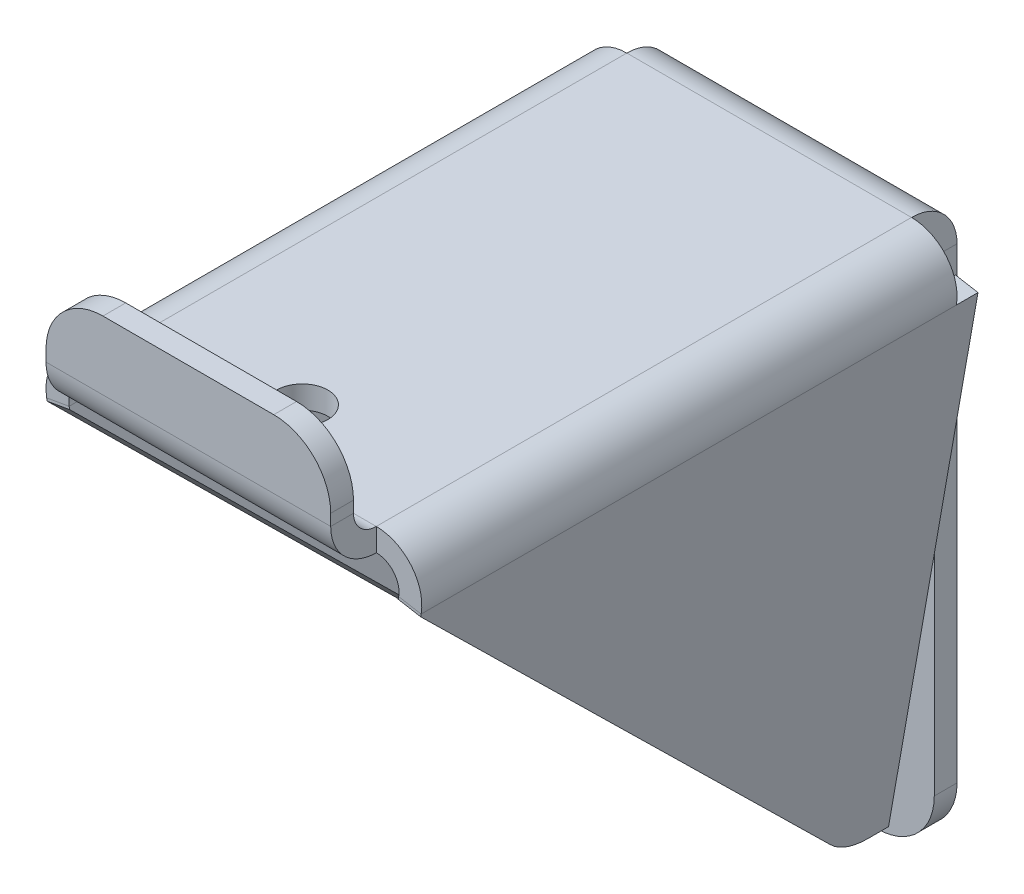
ISO-10303-21;
HEADER;
FILE_DESCRIPTION(('STEP AP214'),'2;1');
FILE_NAME('part.step','',(''),(''),'','','');
FILE_SCHEMA(('AUTOMOTIVE_DESIGN { 1 0 10303 214 1 1 1 1 }'));
ENDSEC;
DATA;
#1=APPLICATION_CONTEXT('core data for automotive mechanical design processes');
#2=APPLICATION_PROTOCOL_DEFINITION('international standard','automotive_design',2000,#1);
#3=PRODUCT_CONTEXT('',#1,'mechanical');
#4=PRODUCT('Part','Part','',(#3));
#5=PRODUCT_RELATED_PRODUCT_CATEGORY('part','',(#4));
#6=PRODUCT_DEFINITION_FORMATION('','',#4);
#7=PRODUCT_DEFINITION_CONTEXT('part definition',#1,'design');
#8=PRODUCT_DEFINITION('design','',#6,#7);
#9=PRODUCT_DEFINITION_SHAPE('','',#8);
#10=(LENGTH_UNIT() NAMED_UNIT(*) SI_UNIT(.MILLI.,.METRE.));
#11=(NAMED_UNIT(*) PLANE_ANGLE_UNIT() SI_UNIT($,.RADIAN.));
#12=(NAMED_UNIT(*) SI_UNIT($,.STERADIAN.) SOLID_ANGLE_UNIT());
#13=UNCERTAINTY_MEASURE_WITH_UNIT(LENGTH_MEASURE(1.E-05),#10,'distance_accuracy_value','');
#14=(GEOMETRIC_REPRESENTATION_CONTEXT(3) GLOBAL_UNCERTAINTY_ASSIGNED_CONTEXT((#13)) GLOBAL_UNIT_ASSIGNED_CONTEXT((#10,
#11,#12)) REPRESENTATION_CONTEXT('',''));
#15=CARTESIAN_POINT('',(0.,0.,0.));
#16=DIRECTION('',(0.,0.,1.));
#17=DIRECTION('',(1.,0.,0.));
#18=AXIS2_PLACEMENT_3D('',#15,#16,#17);
#19=CARTESIAN_POINT('',(12.5,25.0000000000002,53.));
#20=DIRECTION('',(0.,-1.,0.));
#21=DIRECTION('',(0.,0.,-1.));
#22=AXIS2_PLACEMENT_3D('',#19,#20,#21);
#23=PLANE('',#22);
#24=CARTESIAN_POINT('',(0.,25.0000000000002,43.));
#25=DIRECTION('',(0.,1.,0.));
#26=DIRECTION('',(0.,0.,1.));
#27=AXIS2_PLACEMENT_3D('',#24,#25,#26);
#28=CIRCLE('',#27,2.25);
#29=CARTESIAN_POINT('',(0.,25.0000000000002,45.25));
#30=VERTEX_POINT('',#29);
#31=EDGE_CURVE('E672',#30,#30,#28,.T.);
#32=ORIENTED_EDGE('',*,*,#31,.F.);
#33=EDGE_LOOP('',(#32));
#34=FACE_BOUND('',#33,.T.);
#35=DIRECTION('',(1.,0.,0.));
#36=VECTOR('',#35,1.);
#37=CARTESIAN_POINT('',(12.5,25.0000000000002,49.));
#38=LINE('',#37,#36);
#39=CARTESIAN_POINT('',(12.5,25.0000000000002,49.));
#40=VERTEX_POINT('',#39);
#41=CARTESIAN_POINT('',(-12.5,25.0000000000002,49.));
#42=VERTEX_POINT('',#41);
#43=EDGE_CURVE('E462',#40,#42,#38,.F.);
#44=ORIENTED_EDGE('',*,*,#43,.F.);
#45=DIRECTION('',(0.,0.,-1.));
#46=VECTOR('',#45,1.);
#47=CARTESIAN_POINT('',(12.5,25.0000000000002,53.));
#48=LINE('',#47,#46);
#49=CARTESIAN_POINT('',(12.5,25.,1.99999999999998));
#50=VERTEX_POINT('',#49);
#51=EDGE_CURVE('E476',#40,#50,#48,.T.);
#52=ORIENTED_EDGE('',*,*,#51,.T.);
#53=DIRECTION('',(-1.,0.,0.));
#54=VECTOR('',#53,1.);
#55=CARTESIAN_POINT('',(12.5,25.,1.99999999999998));
#56=LINE('',#55,#54);
#57=CARTESIAN_POINT('',(-12.5,25.,1.99999999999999));
#58=VERTEX_POINT('',#57);
#59=EDGE_CURVE('E483',#58,#50,#56,.F.);
#60=ORIENTED_EDGE('',*,*,#59,.F.);
#61=DIRECTION('',(0.,0.,1.));
#62=VECTOR('',#61,1.);
#63=CARTESIAN_POINT('',(-12.5,25.0000000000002,53.));
#64=LINE('',#63,#62);
#65=EDGE_CURVE('E472',#58,#42,#64,.T.);
#66=ORIENTED_EDGE('',*,*,#65,.T.);
#67=EDGE_LOOP('',(#44,#52,#60,#66));
#68=FACE_BOUND('',#67,.T.);
#69=ADVANCED_FACE('F114',(#34,#68),#23,.F.);
#70=CARTESIAN_POINT('',(12.5,23.0000000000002,53.));
#71=DIRECTION('',(0.,-1.,0.));
#72=DIRECTION('',(0.,0.,-1.));
#73=AXIS2_PLACEMENT_3D('',#70,#71,#72);
#74=PLANE('',#73);
#75=CARTESIAN_POINT('',(0.,23.0000000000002,43.));
#76=DIRECTION('',(0.,-1.,0.));
#77=DIRECTION('',(0.,0.,-1.));
#78=AXIS2_PLACEMENT_3D('',#75,#76,#77);
#79=CIRCLE('',#78,2.25);
#80=CARTESIAN_POINT('',(0.,23.0000000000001,40.75));
#81=VERTEX_POINT('',#80);
#82=EDGE_CURVE('E334',#81,#81,#79,.T.);
#83=ORIENTED_EDGE('',*,*,#82,.F.);
#84=EDGE_LOOP('',(#83));
#85=FACE_BOUND('',#84,.T.);
#86=DIRECTION('',(0.,0.,1.));
#87=VECTOR('',#86,1.);
#88=CARTESIAN_POINT('',(12.5,23.,0.));
#89=LINE('',#88,#87);
#90=CARTESIAN_POINT('',(12.5,23.0000000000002,49.));
#91=VERTEX_POINT('',#90);
#92=CARTESIAN_POINT('',(12.5,23.,1.99999999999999));
#93=VERTEX_POINT('',#92);
#94=EDGE_CURVE('E481',#91,#93,#89,.F.);
#95=ORIENTED_EDGE('',*,*,#94,.F.);
#96=DIRECTION('',(1.,0.,0.));
#97=VECTOR('',#96,1.);
#98=CARTESIAN_POINT('',(12.5,23.0000000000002,49.));
#99=LINE('',#98,#97);
#100=CARTESIAN_POINT('',(-12.5,23.0000000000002,49.));
#101=VERTEX_POINT('',#100);
#102=EDGE_CURVE('E449',#91,#101,#99,.F.);
#103=ORIENTED_EDGE('',*,*,#102,.T.);
#104=DIRECTION('',(0.,0.,-1.));
#105=VECTOR('',#104,1.);
#106=CARTESIAN_POINT('',(-12.5,23.0000000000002,53.));
#107=LINE('',#106,#105);
#108=CARTESIAN_POINT('',(-12.5,23.,2.));
#109=VERTEX_POINT('',#108);
#110=EDGE_CURVE('E479',#109,#101,#107,.F.);
#111=ORIENTED_EDGE('',*,*,#110,.F.);
#112=DIRECTION('',(-1.,0.,0.));
#113=VECTOR('',#112,1.);
#114=CARTESIAN_POINT('',(12.5,23.,1.99999999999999));
#115=LINE('',#114,#113);
#116=EDGE_CURVE('E489',#93,#109,#115,.T.);
#117=ORIENTED_EDGE('',*,*,#116,.F.);
#118=EDGE_LOOP('',(#95,#103,#111,#117));
#119=FACE_BOUND('',#118,.T.);
#120=ADVANCED_FACE('F652',(#85,#119),#74,.T.);
#121=CARTESIAN_POINT('',(-12.5,25.,-2.));
#122=DIRECTION('',(-1.,0.,0.));
#123=DIRECTION('',(0.,-1.,0.));
#124=AXIS2_PLACEMENT_3D('',#121,#122,#123);
#125=PLANE('',#124);
#126=DIRECTION('',(0.,-1.,0.));
#127=VECTOR('',#126,1.);
#128=CARTESIAN_POINT('',(-12.5,25.,-2.));
#129=LINE('',#128,#127);
#130=CARTESIAN_POINT('',(-12.5,21.,-2.));
#131=VERTEX_POINT('',#130);
#132=CARTESIAN_POINT('',(-12.5,-20.,-2.));
#133=VERTEX_POINT('',#132);
#134=EDGE_CURVE('E520',#131,#133,#129,.T.);
#135=ORIENTED_EDGE('',*,*,#134,.T.);
#136=DIRECTION('',(0.,0.,1.));
#137=VECTOR('',#136,1.);
#138=CARTESIAN_POINT('',(-12.5,-20.,-2.));
#139=LINE('',#138,#137);
#140=CARTESIAN_POINT('',(-12.5,-20.,0.));
#141=VERTEX_POINT('',#140);
#142=EDGE_CURVE('E566',#133,#141,#139,.T.);
#143=ORIENTED_EDGE('',*,*,#142,.T.);
#144=DIRECTION('',(0.,-1.,0.));
#145=VECTOR('',#144,1.);
#146=CARTESIAN_POINT('',(-12.5,25.,0.));
#147=LINE('',#146,#145);
#148=CARTESIAN_POINT('',(-12.5,21.,0.));
#149=VERTEX_POINT('',#148);
#150=EDGE_CURVE('E529',#149,#141,#147,.T.);
#151=ORIENTED_EDGE('',*,*,#150,.F.);
#152=DIRECTION('',(0.,0.,-1.));
#153=VECTOR('',#152,1.);
#154=CARTESIAN_POINT('',(-12.5,21.,0.));
#155=LINE('',#154,#153);
#156=EDGE_CURVE('E501',#149,#131,#155,.T.);
#157=ORIENTED_EDGE('',*,*,#156,.T.);
#158=EDGE_LOOP('',(#135,#143,#151,#157));
#159=FACE_BOUND('',#158,.T.);
#160=ADVANCED_FACE('F693',(#159),#125,.T.);
#161=CARTESIAN_POINT('',(12.5,-25.,-2.));
#162=DIRECTION('',(0.,0.,1.));
#163=DIRECTION('',(1.,0.,0.));
#164=AXIS2_PLACEMENT_3D('',#161,#162,#163);
#165=PLANE('',#164);
#166=CARTESIAN_POINT('',(0.,10.,-2.));
#167=DIRECTION('',(0.,0.,1.));
#168=DIRECTION('',(1.,0.,0.));
#169=AXIS2_PLACEMENT_3D('',#166,#167,#168);
#170=CIRCLE('',#169,2.75);
#171=CARTESIAN_POINT('',(2.75,10.,-2.));
#172=VERTEX_POINT('',#171);
#173=EDGE_CURVE('E675',#172,#172,#170,.T.);
#174=ORIENTED_EDGE('',*,*,#173,.T.);
#175=EDGE_LOOP('',(#174));
#176=FACE_BOUND('',#175,.T.);
#177=DIRECTION('',(1.,0.,0.));
#178=VECTOR('',#177,1.);
#179=CARTESIAN_POINT('',(-12.5,-25.,-2.));
#180=LINE('',#179,#178);
#181=CARTESIAN_POINT('',(-7.5,-25.,-2.));
#182=VERTEX_POINT('',#181);
#183=CARTESIAN_POINT('',(7.5,-25.,-2.));
#184=VERTEX_POINT('',#183);
#185=EDGE_CURVE('E524',#182,#184,#180,.T.);
#186=ORIENTED_EDGE('',*,*,#185,.F.);
#187=CARTESIAN_POINT('',(-7.5,-20.,-2.));
#188=DIRECTION('',(0.,0.,1.));
#189=DIRECTION('',(1.,0.,0.));
#190=AXIS2_PLACEMENT_3D('',#187,#188,#189);
#191=CIRCLE('',#190,5.);
#192=EDGE_CURVE('E580',#182,#133,#191,.F.);
#193=ORIENTED_EDGE('',*,*,#192,.T.);
#194=ORIENTED_EDGE('',*,*,#134,.F.);
#195=DIRECTION('',(-1.,0.,0.));
#196=VECTOR('',#195,1.);
#197=CARTESIAN_POINT('',(-12.5,21.,-2.));
#198=LINE('',#197,#196);
#199=CARTESIAN_POINT('',(12.5,21.,-2.));
#200=VERTEX_POINT('',#199);
#201=EDGE_CURVE('E494',#131,#200,#198,.F.);
#202=ORIENTED_EDGE('',*,*,#201,.T.);
#203=DIRECTION('',(0.,1.,0.));
#204=VECTOR('',#203,1.);
#205=CARTESIAN_POINT('',(12.5,25.,-2.));
#206=LINE('',#205,#204);
#207=CARTESIAN_POINT('',(12.5,-20.,-2.));
#208=VERTEX_POINT('',#207);
#209=EDGE_CURVE('E518',#208,#200,#206,.T.);
#210=ORIENTED_EDGE('',*,*,#209,.F.);
#211=CARTESIAN_POINT('',(7.5,-20.,-2.));
#212=DIRECTION('',(0.,0.,1.));
#213=DIRECTION('',(1.,0.,0.));
#214=AXIS2_PLACEMENT_3D('',#211,#212,#213);
#215=CIRCLE('',#214,5.);
#216=EDGE_CURVE('E578',#208,#184,#215,.F.);
#217=ORIENTED_EDGE('',*,*,#216,.T.);
#218=EDGE_LOOP('',(#186,#193,#194,#202,#210,#217));
#219=FACE_BOUND('',#218,.T.);
#220=ADVANCED_FACE('F688',(#176,#219),#165,.F.);
#221=CARTESIAN_POINT('',(12.5,-25.,0.));
#222=DIRECTION('',(0.,0.,1.));
#223=DIRECTION('',(1.,0.,0.));
#224=AXIS2_PLACEMENT_3D('',#221,#222,#223);
#225=PLANE('',#224);
#226=CARTESIAN_POINT('',(0.,10.,0.));
#227=DIRECTION('',(0.,0.,1.));
#228=DIRECTION('',(1.,0.,0.));
#229=AXIS2_PLACEMENT_3D('',#226,#227,#228);
#230=CIRCLE('',#229,2.75);
#231=CARTESIAN_POINT('',(2.75,10.,0.));
#232=VERTEX_POINT('',#231);
#233=EDGE_CURVE('E678',#232,#232,#230,.T.);
#234=ORIENTED_EDGE('',*,*,#233,.F.);
#235=EDGE_LOOP('',(#234));
#236=FACE_BOUND('',#235,.T.);
#237=ORIENTED_EDGE('',*,*,#150,.T.);
#238=CARTESIAN_POINT('',(-7.5,-20.,0.));
#239=DIRECTION('',(0.,0.,1.));
#240=DIRECTION('',(1.,0.,0.));
#241=AXIS2_PLACEMENT_3D('',#238,#239,#240);
#242=CIRCLE('',#241,5.);
#243=CARTESIAN_POINT('',(-7.5,-25.,0.));
#244=VERTEX_POINT('',#243);
#245=EDGE_CURVE('E571',#141,#244,#242,.T.);
#246=ORIENTED_EDGE('',*,*,#245,.T.);
#247=DIRECTION('',(1.,0.,0.));
#248=VECTOR('',#247,1.);
#249=CARTESIAN_POINT('',(-12.5,-25.,0.));
#250=LINE('',#249,#248);
#251=CARTESIAN_POINT('',(7.5,-25.,0.));
#252=VERTEX_POINT('',#251);
#253=EDGE_CURVE('E521',#244,#252,#250,.T.);
#254=ORIENTED_EDGE('',*,*,#253,.T.);
#255=CARTESIAN_POINT('',(7.5,-20.,0.));
#256=DIRECTION('',(0.,0.,1.));
#257=DIRECTION('',(1.,0.,0.));
#258=AXIS2_PLACEMENT_3D('',#255,#256,#257);
#259=CIRCLE('',#258,5.);
#260=CARTESIAN_POINT('',(12.5,-20.,0.));
#261=VERTEX_POINT('',#260);
#262=EDGE_CURVE('E569',#252,#261,#259,.T.);
#263=ORIENTED_EDGE('',*,*,#262,.T.);
#264=DIRECTION('',(0.,1.,0.));
#265=VECTOR('',#264,1.);
#266=CARTESIAN_POINT('',(12.5,25.,0.));
#267=LINE('',#266,#265);
#268=CARTESIAN_POINT('',(12.5,21.,0.));
#269=VERTEX_POINT('',#268);
#270=EDGE_CURVE('E515',#261,#269,#267,.T.);
#271=ORIENTED_EDGE('',*,*,#270,.T.);
#272=DIRECTION('',(-1.,0.,0.));
#273=VECTOR('',#272,1.);
#274=CARTESIAN_POINT('',(-12.5,21.,0.));
#275=LINE('',#274,#273);
#276=EDGE_CURVE('E507',#149,#269,#275,.F.);
#277=ORIENTED_EDGE('',*,*,#276,.F.);
#278=EDGE_LOOP('',(#237,#246,#254,#263,#271,#277));
#279=FACE_BOUND('',#278,.T.);
#280=ADVANCED_FACE('F684',(#236,#279),#225,.T.);
#281=CARTESIAN_POINT('',(12.5,25.,-2.));
#282=DIRECTION('',(1.,0.,0.));
#283=DIRECTION('',(0.,1.,0.));
#284=AXIS2_PLACEMENT_3D('',#281,#282,#283);
#285=PLANE('',#284);
#286=ORIENTED_EDGE('',*,*,#270,.F.);
#287=DIRECTION('',(0.,0.,1.));
#288=VECTOR('',#287,1.);
#289=CARTESIAN_POINT('',(12.5,-20.,-2.));
#290=LINE('',#289,#288);
#291=EDGE_CURVE('E582',#261,#208,#290,.F.);
#292=ORIENTED_EDGE('',*,*,#291,.T.);
#293=ORIENTED_EDGE('',*,*,#209,.T.);
#294=DIRECTION('',(0.,0.,-1.));
#295=VECTOR('',#294,1.);
#296=CARTESIAN_POINT('',(12.5,21.,0.));
#297=LINE('',#296,#295);
#298=EDGE_CURVE('E512',#269,#200,#297,.T.);
#299=ORIENTED_EDGE('',*,*,#298,.F.);
#300=EDGE_LOOP('',(#286,#292,#293,#299));
#301=FACE_BOUND('',#300,.T.);
#302=ADVANCED_FACE('F687',(#301),#285,.T.);
#303=CARTESIAN_POINT('',(-12.5,-25.,-2.));
#304=DIRECTION('',(0.,-1.,0.));
#305=DIRECTION('',(0.,0.,-1.));
#306=AXIS2_PLACEMENT_3D('',#303,#304,#305);
#307=PLANE('',#306);
#308=ORIENTED_EDGE('',*,*,#253,.F.);
#309=DIRECTION('',(0.,0.,1.));
#310=VECTOR('',#309,1.);
#311=CARTESIAN_POINT('',(-7.5,-25.,-2.));
#312=LINE('',#311,#310);
#313=EDGE_CURVE('E576',#244,#182,#312,.F.);
#314=ORIENTED_EDGE('',*,*,#313,.T.);
#315=ORIENTED_EDGE('',*,*,#185,.T.);
#316=DIRECTION('',(0.,0.,1.));
#317=VECTOR('',#316,1.);
#318=CARTESIAN_POINT('',(7.5,-25.,-2.));
#319=LINE('',#318,#317);
#320=EDGE_CURVE('E573',#184,#252,#319,.T.);
#321=ORIENTED_EDGE('',*,*,#320,.T.);
#322=EDGE_LOOP('',(#308,#314,#315,#321));
#323=FACE_BOUND('',#322,.T.);
#324=ADVANCED_FACE('F701',(#323),#307,.T.);
#325=CARTESIAN_POINT('',(12.5,21.,2.));
#326=DIRECTION('',(1.,0.,0.));
#327=DIRECTION('',(0.,0.,-1.));
#328=AXIS2_PLACEMENT_3D('',#325,#326,#327);
#329=PLANE('',#328);
#330=DIRECTION('',(0.,-1.,0.));
#331=VECTOR('',#330,1.);
#332=CARTESIAN_POINT('',(12.5,25.,1.99999999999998));
#333=LINE('',#332,#331);
#334=EDGE_CURVE('E470',#93,#50,#333,.F.);
#335=ORIENTED_EDGE('',*,*,#334,.F.);
#336=CARTESIAN_POINT('',(12.5,21.,2.));
#337=DIRECTION('',(-1.,0.,0.));
#338=DIRECTION('',(0.,0.,1.));
#339=AXIS2_PLACEMENT_3D('',#336,#337,#338);
#340=CIRCLE('',#339,2.);
#341=EDGE_CURVE('E504',#269,#93,#340,.F.);
#342=ORIENTED_EDGE('',*,*,#341,.F.);
#343=ORIENTED_EDGE('',*,*,#298,.T.);
#344=CARTESIAN_POINT('',(12.5,21.,2.));
#345=DIRECTION('',(-1.,0.,0.));
#346=DIRECTION('',(0.,0.,1.));
#347=AXIS2_PLACEMENT_3D('',#344,#345,#346);
#348=CIRCLE('',#347,4.);
#349=EDGE_CURVE('E497',#200,#50,#348,.F.);
#350=ORIENTED_EDGE('',*,*,#349,.T.);
#351=EDGE_LOOP('',(#335,#342,#343,#350));
#352=FACE_BOUND('',#351,.T.);
#353=ADVANCED_FACE('F716',(#352),#329,.T.);
#354=CARTESIAN_POINT('',(-12.5,21.,2.));
#355=DIRECTION('',(1.,0.,0.));
#356=DIRECTION('',(0.,0.,-1.));
#357=AXIS2_PLACEMENT_3D('',#354,#355,#356);
#358=PLANE('',#357);
#359=CARTESIAN_POINT('',(-12.5,21.,2.));
#360=DIRECTION('',(-1.,0.,0.));
#361=DIRECTION('',(0.,0.,1.));
#362=AXIS2_PLACEMENT_3D('',#359,#360,#361);
#363=CIRCLE('',#362,2.);
#364=EDGE_CURVE('E475',#109,#149,#363,.T.);
#365=ORIENTED_EDGE('',*,*,#364,.F.);
#366=DIRECTION('',(0.,-1.,0.));
#367=VECTOR('',#366,1.);
#368=CARTESIAN_POINT('',(-12.5,23.,1.99999999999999));
#369=LINE('',#368,#367);
#370=EDGE_CURVE('E486',#109,#58,#369,.F.);
#371=ORIENTED_EDGE('',*,*,#370,.T.);
#372=CARTESIAN_POINT('',(-12.5,21.,2.));
#373=DIRECTION('',(-1.,0.,0.));
#374=DIRECTION('',(0.,0.,1.));
#375=AXIS2_PLACEMENT_3D('',#372,#373,#374);
#376=CIRCLE('',#375,4.);
#377=EDGE_CURVE('E498',#58,#131,#376,.T.);
#378=ORIENTED_EDGE('',*,*,#377,.T.);
#379=ORIENTED_EDGE('',*,*,#156,.F.);
#380=EDGE_LOOP('',(#365,#371,#378,#379));
#381=FACE_BOUND('',#380,.T.);
#382=ADVANCED_FACE('F647',(#381),#358,.F.);
#383=CARTESIAN_POINT('',(-12.5,21.,2.));
#384=DIRECTION('',(-1.,0.,0.));
#385=DIRECTION('',(0.,1.,0.));
#386=AXIS2_PLACEMENT_3D('',#383,#384,#385);
#387=CYLINDRICAL_SURFACE('',#386,4.);
#388=ORIENTED_EDGE('',*,*,#201,.F.);
#389=ORIENTED_EDGE('',*,*,#377,.F.);
#390=ORIENTED_EDGE('',*,*,#59,.T.);
#391=ORIENTED_EDGE('',*,*,#349,.F.);
#392=EDGE_LOOP('',(#388,#389,#390,#391));
#393=FACE_BOUND('',#392,.T.);
#394=ADVANCED_FACE('F642',(#393),#387,.T.);
#395=CARTESIAN_POINT('',(-12.5,21.,2.));
#396=DIRECTION('',(-1.,0.,0.));
#397=DIRECTION('',(0.,1.,0.));
#398=AXIS2_PLACEMENT_3D('',#395,#396,#397);
#399=CYLINDRICAL_SURFACE('',#398,2.);
#400=ORIENTED_EDGE('',*,*,#276,.T.);
#401=ORIENTED_EDGE('',*,*,#341,.T.);
#402=ORIENTED_EDGE('',*,*,#116,.T.);
#403=ORIENTED_EDGE('',*,*,#364,.T.);
#404=EDGE_LOOP('',(#400,#401,#402,#403));
#405=FACE_BOUND('',#404,.T.);
#406=ADVANCED_FACE('F714',(#405),#399,.F.);
#407=CARTESIAN_POINT('',(-12.5,27.0000000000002,49.));
#408=DIRECTION('',(-1.,0.,0.));
#409=DIRECTION('',(0.,0.,1.));
#410=AXIS2_PLACEMENT_3D('',#407,#408,#409);
#411=PLANE('',#410);
#412=DIRECTION('',(0.,0.,-1.));
#413=VECTOR('',#412,1.);
#414=CARTESIAN_POINT('',(-12.5,27.0000000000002,53.));
#415=LINE('',#414,#413);
#416=CARTESIAN_POINT('',(-12.5,27.0000000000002,51.));
#417=VERTEX_POINT('',#416);
#418=CARTESIAN_POINT('',(-12.5,27.0000000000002,53.));
#419=VERTEX_POINT('',#418);
#420=EDGE_CURVE('E416',#417,#419,#415,.F.);
#421=ORIENTED_EDGE('',*,*,#420,.F.);
#422=CARTESIAN_POINT('',(-12.5,27.0000000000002,49.));
#423=DIRECTION('',(1.,0.,0.));
#424=DIRECTION('',(0.,0.,-1.));
#425=AXIS2_PLACEMENT_3D('',#422,#423,#424);
#426=CIRCLE('',#425,2.00000000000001);
#427=EDGE_CURVE('E459',#42,#417,#426,.F.);
#428=ORIENTED_EDGE('',*,*,#427,.F.);
#429=DIRECTION('',(0.,-1.,0.));
#430=VECTOR('',#429,1.);
#431=CARTESIAN_POINT('',(-12.5,25.0000000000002,49.));
#432=LINE('',#431,#430);
#433=EDGE_CURVE('E467',#42,#101,#432,.T.);
#434=ORIENTED_EDGE('',*,*,#433,.T.);
#435=CARTESIAN_POINT('',(-12.5,27.0000000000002,49.));
#436=DIRECTION('',(1.,0.,0.));
#437=DIRECTION('',(0.,0.,-1.));
#438=AXIS2_PLACEMENT_3D('',#435,#436,#437);
#439=CIRCLE('',#438,4.00000000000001);
#440=EDGE_CURVE('E452',#101,#419,#439,.F.);
#441=ORIENTED_EDGE('',*,*,#440,.T.);
#442=EDGE_LOOP('',(#421,#428,#434,#441));
#443=FACE_BOUND('',#442,.T.);
#444=ADVANCED_FACE('F622',(#443),#411,.T.);
#445=CARTESIAN_POINT('',(12.5,27.0000000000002,49.));
#446=DIRECTION('',(-1.,0.,0.));
#447=DIRECTION('',(0.,0.,1.));
#448=AXIS2_PLACEMENT_3D('',#445,#446,#447);
#449=PLANE('',#448);
#450=CARTESIAN_POINT('',(12.5,27.0000000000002,49.));
#451=DIRECTION('',(1.,0.,0.));
#452=DIRECTION('',(0.,0.,-1.));
#453=AXIS2_PLACEMENT_3D('',#450,#451,#452);
#454=CIRCLE('',#453,2.00000000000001);
#455=CARTESIAN_POINT('',(12.5,27.0000000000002,51.));
#456=VERTEX_POINT('',#455);
#457=EDGE_CURVE('E427',#456,#40,#454,.T.);
#458=ORIENTED_EDGE('',*,*,#457,.F.);
#459=DIRECTION('',(0.,0.,-1.));
#460=VECTOR('',#459,1.);
#461=CARTESIAN_POINT('',(12.5,27.0000000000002,51.));
#462=LINE('',#461,#460);
#463=CARTESIAN_POINT('',(12.5,27.0000000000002,53.));
#464=VERTEX_POINT('',#463);
#465=EDGE_CURVE('E442',#456,#464,#462,.F.);
#466=ORIENTED_EDGE('',*,*,#465,.T.);
#467=CARTESIAN_POINT('',(12.5,27.0000000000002,49.));
#468=DIRECTION('',(1.,0.,0.));
#469=DIRECTION('',(0.,0.,-1.));
#470=AXIS2_PLACEMENT_3D('',#467,#468,#469);
#471=CIRCLE('',#470,4.00000000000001);
#472=EDGE_CURVE('E453',#464,#91,#471,.T.);
#473=ORIENTED_EDGE('',*,*,#472,.T.);
#474=DIRECTION('',(0.,-1.,0.));
#475=VECTOR('',#474,1.);
#476=CARTESIAN_POINT('',(12.5,25.0000000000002,49.));
#477=LINE('',#476,#475);
#478=EDGE_CURVE('E456',#40,#91,#477,.T.);
#479=ORIENTED_EDGE('',*,*,#478,.F.);
#480=EDGE_LOOP('',(#458,#466,#473,#479));
#481=FACE_BOUND('',#480,.T.);
#482=ADVANCED_FACE('F613',(#481),#449,.F.);
#483=CARTESIAN_POINT('',(12.5,27.0000000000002,49.));
#484=DIRECTION('',(1.,0.,0.));
#485=DIRECTION('',(0.,0.,1.));
#486=AXIS2_PLACEMENT_3D('',#483,#484,#485);
#487=CYLINDRICAL_SURFACE('',#486,4.00000000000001);
#488=ORIENTED_EDGE('',*,*,#102,.F.);
#489=ORIENTED_EDGE('',*,*,#472,.F.);
#490=DIRECTION('',(1.,0.,0.));
#491=VECTOR('',#490,1.);
#492=CARTESIAN_POINT('',(-12.5,27.0000000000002,53.));
#493=LINE('',#492,#491);
#494=EDGE_CURVE('E439',#464,#419,#493,.F.);
#495=ORIENTED_EDGE('',*,*,#494,.T.);
#496=ORIENTED_EDGE('',*,*,#440,.F.);
#497=EDGE_LOOP('',(#488,#489,#495,#496));
#498=FACE_BOUND('',#497,.T.);
#499=ADVANCED_FACE('F619',(#498),#487,.T.);
#500=CARTESIAN_POINT('',(12.5,27.0000000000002,49.));
#501=DIRECTION('',(1.,0.,0.));
#502=DIRECTION('',(0.,0.,1.));
#503=AXIS2_PLACEMENT_3D('',#500,#501,#502);
#504=CYLINDRICAL_SURFACE('',#503,2.00000000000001);
#505=ORIENTED_EDGE('',*,*,#43,.T.);
#506=ORIENTED_EDGE('',*,*,#427,.T.);
#507=DIRECTION('',(1.,0.,0.));
#508=VECTOR('',#507,1.);
#509=CARTESIAN_POINT('',(-12.5,27.0000000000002,51.));
#510=LINE('',#509,#508);
#511=EDGE_CURVE('E445',#417,#456,#510,.T.);
#512=ORIENTED_EDGE('',*,*,#511,.T.);
#513=ORIENTED_EDGE('',*,*,#457,.T.);
#514=EDGE_LOOP('',(#505,#506,#512,#513));
#515=FACE_BOUND('',#514,.T.);
#516=ADVANCED_FACE('F630',(#515),#504,.F.);
#517=CARTESIAN_POINT('',(-12.5,25.0000000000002,53.));
#518=DIRECTION('',(1.,0.,0.));
#519=DIRECTION('',(0.,0.,-1.));
#520=AXIS2_PLACEMENT_3D('',#517,#518,#519);
#521=PLANE('',#520);
#522=DIRECTION('',(0.,-1.,0.));
#523=VECTOR('',#522,1.);
#524=CARTESIAN_POINT('',(-12.5,33.0000000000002,53.));
#525=LINE('',#524,#523);
#526=CARTESIAN_POINT('',(-12.5,28.0000000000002,53.));
#527=VERTEX_POINT('',#526);
#528=EDGE_CURVE('E430',#527,#419,#525,.T.);
#529=ORIENTED_EDGE('',*,*,#528,.F.);
#530=DIRECTION('',(0.,0.,-1.));
#531=VECTOR('',#530,1.);
#532=CARTESIAN_POINT('',(-12.5,28.0000000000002,53.));
#533=LINE('',#532,#531);
#534=CARTESIAN_POINT('',(-12.5,28.0000000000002,51.));
#535=VERTEX_POINT('',#534);
#536=EDGE_CURVE('E13',#527,#535,#533,.T.);
#537=ORIENTED_EDGE('',*,*,#536,.T.);
#538=DIRECTION('',(0.,1.,0.));
#539=VECTOR('',#538,1.);
#540=CARTESIAN_POINT('',(-12.5,25.0000000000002,51.));
#541=LINE('',#540,#539);
#542=EDGE_CURVE('E437',#535,#417,#541,.F.);
#543=ORIENTED_EDGE('',*,*,#542,.T.);
#544=ORIENTED_EDGE('',*,*,#420,.T.);
#545=EDGE_LOOP('',(#529,#537,#543,#544));
#546=FACE_BOUND('',#545,.T.);
#547=ADVANCED_FACE('F626',(#546),#521,.F.);
#548=CARTESIAN_POINT('',(12.5,33.0000000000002,53.));
#549=DIRECTION('',(-1.,0.,0.));
#550=DIRECTION('',(0.,-1.,0.));
#551=AXIS2_PLACEMENT_3D('',#548,#549,#550);
#552=PLANE('',#551);
#553=DIRECTION('',(0.,-1.,0.));
#554=VECTOR('',#553,1.);
#555=CARTESIAN_POINT('',(12.5,33.0000000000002,51.));
#556=LINE('',#555,#554);
#557=CARTESIAN_POINT('',(12.5,28.0000000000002,51.));
#558=VERTEX_POINT('',#557);
#559=EDGE_CURVE('E435',#456,#558,#556,.F.);
#560=ORIENTED_EDGE('',*,*,#559,.T.);
#561=DIRECTION('',(0.,0.,-1.));
#562=VECTOR('',#561,1.);
#563=CARTESIAN_POINT('',(12.5,28.0000000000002,53.));
#564=LINE('',#563,#562);
#565=CARTESIAN_POINT('',(12.5,28.0000000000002,53.));
#566=VERTEX_POINT('',#565);
#567=EDGE_CURVE('E137',#558,#566,#564,.F.);
#568=ORIENTED_EDGE('',*,*,#567,.T.);
#569=DIRECTION('',(0.,1.,0.));
#570=VECTOR('',#569,1.);
#571=CARTESIAN_POINT('',(12.5,33.0000000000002,53.));
#572=LINE('',#571,#570);
#573=EDGE_CURVE('E428',#464,#566,#572,.T.);
#574=ORIENTED_EDGE('',*,*,#573,.F.);
#575=ORIENTED_EDGE('',*,*,#465,.F.);
#576=EDGE_LOOP('',(#560,#568,#574,#575));
#577=FACE_BOUND('',#576,.T.);
#578=ADVANCED_FACE('F610',(#577),#552,.F.);
#579=CARTESIAN_POINT('',(-12.5,33.0000000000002,53.));
#580=DIRECTION('',(0.,0.,-1.));
#581=DIRECTION('',(-1.,0.,0.));
#582=AXIS2_PLACEMENT_3D('',#579,#580,#581);
#583=PLANE('',#582);
#584=ORIENTED_EDGE('',*,*,#573,.T.);
#585=CARTESIAN_POINT('',(7.49999999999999,28.0000000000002,53.));
#586=DIRECTION('',(0.,0.,-1.));
#587=DIRECTION('',(-1.,0.,0.));
#588=AXIS2_PLACEMENT_3D('',#585,#586,#587);
#589=CIRCLE('',#588,5.);
#590=CARTESIAN_POINT('',(7.49999999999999,33.0000000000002,53.));
#591=VERTEX_POINT('',#590);
#592=EDGE_CURVE('E122',#566,#591,#589,.F.);
#593=ORIENTED_EDGE('',*,*,#592,.T.);
#594=DIRECTION('',(-1.,0.,0.));
#595=VECTOR('',#594,1.);
#596=CARTESIAN_POINT('',(-12.5,33.0000000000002,53.));
#597=LINE('',#596,#595);
#598=CARTESIAN_POINT('',(-7.5,33.0000000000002,53.));
#599=VERTEX_POINT('',#598);
#600=EDGE_CURVE('E425',#591,#599,#597,.T.);
#601=ORIENTED_EDGE('',*,*,#600,.T.);
#602=CARTESIAN_POINT('',(-7.5,28.0000000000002,53.));
#603=DIRECTION('',(0.,0.,-1.));
#604=DIRECTION('',(-1.,0.,0.));
#605=AXIS2_PLACEMENT_3D('',#602,#603,#604);
#606=CIRCLE('',#605,5.);
#607=EDGE_CURVE('E129',#599,#527,#606,.F.);
#608=ORIENTED_EDGE('',*,*,#607,.T.);
#609=ORIENTED_EDGE('',*,*,#528,.T.);
#610=ORIENTED_EDGE('',*,*,#494,.F.);
#611=EDGE_LOOP('',(#584,#593,#601,#608,#609,#610));
#612=FACE_BOUND('',#611,.T.);
#613=ADVANCED_FACE('F596',(#612),#583,.F.);
#614=CARTESIAN_POINT('',(-12.5,33.0000000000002,51.));
#615=DIRECTION('',(0.,0.,-1.));
#616=DIRECTION('',(-1.,0.,0.));
#617=AXIS2_PLACEMENT_3D('',#614,#615,#616);
#618=PLANE('',#617);
#619=DIRECTION('',(1.,0.,0.));
#620=VECTOR('',#619,1.);
#621=CARTESIAN_POINT('',(-12.5,33.0000000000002,51.));
#622=LINE('',#621,#620);
#623=CARTESIAN_POINT('',(7.49999999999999,33.0000000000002,51.));
#624=VERTEX_POINT('',#623);
#625=CARTESIAN_POINT('',(-7.5,33.0000000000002,51.));
#626=VERTEX_POINT('',#625);
#627=EDGE_CURVE('E432',#624,#626,#622,.F.);
#628=ORIENTED_EDGE('',*,*,#627,.F.);
#629=CARTESIAN_POINT('',(7.49999999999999,28.0000000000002,51.));
#630=DIRECTION('',(0.,0.,-1.));
#631=DIRECTION('',(-1.,0.,0.));
#632=AXIS2_PLACEMENT_3D('',#629,#630,#631);
#633=CIRCLE('',#632,5.);
#634=EDGE_CURVE('E591',#624,#558,#633,.T.);
#635=ORIENTED_EDGE('',*,*,#634,.T.);
#636=ORIENTED_EDGE('',*,*,#559,.F.);
#637=ORIENTED_EDGE('',*,*,#511,.F.);
#638=ORIENTED_EDGE('',*,*,#542,.F.);
#639=CARTESIAN_POINT('',(-7.5,28.0000000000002,51.));
#640=DIRECTION('',(0.,0.,-1.));
#641=DIRECTION('',(-1.,0.,0.));
#642=AXIS2_PLACEMENT_3D('',#639,#640,#641);
#643=CIRCLE('',#642,5.);
#644=EDGE_CURVE('E589',#535,#626,#643,.T.);
#645=ORIENTED_EDGE('',*,*,#644,.T.);
#646=EDGE_LOOP('',(#628,#635,#636,#637,#638,#645));
#647=FACE_BOUND('',#646,.T.);
#648=ADVANCED_FACE('F607',(#647),#618,.T.);
#649=CARTESIAN_POINT('',(-12.5,33.0000000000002,53.));
#650=DIRECTION('',(0.,-1.,0.));
#651=DIRECTION('',(0.,0.,-1.));
#652=AXIS2_PLACEMENT_3D('',#649,#650,#651);
#653=PLANE('',#652);
#654=ORIENTED_EDGE('',*,*,#600,.F.);
#655=DIRECTION('',(0.,0.,-1.));
#656=VECTOR('',#655,1.);
#657=CARTESIAN_POINT('',(7.49999999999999,33.0000000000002,53.));
#658=LINE('',#657,#656);
#659=EDGE_CURVE('E586',#591,#624,#658,.T.);
#660=ORIENTED_EDGE('',*,*,#659,.T.);
#661=ORIENTED_EDGE('',*,*,#627,.T.);
#662=DIRECTION('',(0.,0.,-1.));
#663=VECTOR('',#662,1.);
#664=CARTESIAN_POINT('',(-7.5,33.0000000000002,53.));
#665=LINE('',#664,#663);
#666=EDGE_CURVE('E584',#626,#599,#665,.F.);
#667=ORIENTED_EDGE('',*,*,#666,.T.);
#668=EDGE_LOOP('',(#654,#660,#661,#667));
#669=FACE_BOUND('',#668,.T.);
#670=ADVANCED_FACE('F601',(#669),#653,.F.);
#671=CARTESIAN_POINT('',(12.5,21.,2.));
#672=DIRECTION('',(0.,0.,-1.));
#673=DIRECTION('',(0.,1.,0.));
#674=AXIS2_PLACEMENT_3D('',#671,#672,#673);
#675=PLANE('',#674);
#676=DIRECTION('',(-0.984807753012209,0.173648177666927,0.));
#677=VECTOR('',#676,1.);
#678=CARTESIAN_POINT('',(16.4392310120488,20.3054072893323,2.));
#679=LINE('',#678,#677);
#680=CARTESIAN_POINT('',(14.4696155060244,20.6527036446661,2.));
#681=VERTEX_POINT('',#680);
#682=CARTESIAN_POINT('',(16.4392310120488,20.3054072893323,2.));
#683=VERTEX_POINT('',#682);
#684=EDGE_CURVE('E384',#681,#683,#679,.F.);
#685=ORIENTED_EDGE('',*,*,#684,.F.);
#686=CARTESIAN_POINT('',(12.5,21.,2.));
#687=DIRECTION('',(0.,0.,1.));
#688=DIRECTION('',(0.,-1.,0.));
#689=AXIS2_PLACEMENT_3D('',#686,#687,#688);
#690=CIRCLE('',#689,2.);
#691=EDGE_CURVE('E420',#93,#681,#690,.F.);
#692=ORIENTED_EDGE('',*,*,#691,.F.);
#693=ORIENTED_EDGE('',*,*,#334,.T.);
#694=CARTESIAN_POINT('',(12.5,21.,2.));
#695=DIRECTION('',(0.,0.,1.));
#696=DIRECTION('',(0.,-1.,0.));
#697=AXIS2_PLACEMENT_3D('',#694,#695,#696);
#698=CIRCLE('',#697,4.);
#699=EDGE_CURVE('E413',#50,#683,#698,.F.);
#700=ORIENTED_EDGE('',*,*,#699,.T.);
#701=EDGE_LOOP('',(#685,#692,#693,#700));
#702=FACE_BOUND('',#701,.T.);
#703=ADVANCED_FACE('F719',(#702),#675,.T.);
#704=CARTESIAN_POINT('',(12.5,21.0000000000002,49.));
#705=DIRECTION('',(0.,0.,-1.));
#706=DIRECTION('',(0.,1.,0.));
#707=AXIS2_PLACEMENT_3D('',#704,#705,#706);
#708=PLANE('',#707);
#709=CARTESIAN_POINT('',(12.5,21.0000000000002,49.));
#710=DIRECTION('',(0.,0.,1.));
#711=DIRECTION('',(0.,-1.,0.));
#712=AXIS2_PLACEMENT_3D('',#709,#710,#711);
#713=CIRCLE('',#712,2.);
#714=CARTESIAN_POINT('',(14.4696155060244,20.6527036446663,49.));
#715=VERTEX_POINT('',#714);
#716=EDGE_CURVE('E395',#715,#91,#713,.T.);
#717=ORIENTED_EDGE('',*,*,#716,.F.);
#718=DIRECTION('',(-0.984807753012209,0.173648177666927,0.));
#719=VECTOR('',#718,1.);
#720=CARTESIAN_POINT('',(14.4696155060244,20.6527036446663,49.));
#721=LINE('',#720,#719);
#722=CARTESIAN_POINT('',(16.4392310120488,20.3054072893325,49.));
#723=VERTEX_POINT('',#722);
#724=EDGE_CURVE('E406',#715,#723,#721,.F.);
#725=ORIENTED_EDGE('',*,*,#724,.T.);
#726=CARTESIAN_POINT('',(12.5,21.0000000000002,49.));
#727=DIRECTION('',(0.,0.,1.));
#728=DIRECTION('',(0.,-1.,0.));
#729=AXIS2_PLACEMENT_3D('',#726,#727,#728);
#730=CIRCLE('',#729,4.);
#731=EDGE_CURVE('E417',#723,#40,#730,.T.);
#732=ORIENTED_EDGE('',*,*,#731,.T.);
#733=ORIENTED_EDGE('',*,*,#478,.T.);
#734=EDGE_LOOP('',(#717,#725,#732,#733));
#735=FACE_BOUND('',#734,.T.);
#736=ADVANCED_FACE('F724',(#735),#708,.F.);
#737=CARTESIAN_POINT('',(12.5,21.0000000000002,49.));
#738=DIRECTION('',(0.,0.,1.));
#739=DIRECTION('',(0.984807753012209,-0.173648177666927,0.));
#740=AXIS2_PLACEMENT_3D('',#737,#738,#739);
#741=CYLINDRICAL_SURFACE('',#740,4.);
#742=ORIENTED_EDGE('',*,*,#51,.F.);
#743=ORIENTED_EDGE('',*,*,#731,.F.);
#744=DIRECTION('',(0.,0.,1.));
#745=VECTOR('',#744,1.);
#746=CARTESIAN_POINT('',(16.4392310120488,20.3054072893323,2.00000000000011));
#747=LINE('',#746,#745);
#748=EDGE_CURVE('E404',#723,#683,#747,.F.);
#749=ORIENTED_EDGE('',*,*,#748,.T.);
#750=ORIENTED_EDGE('',*,*,#699,.F.);
#751=EDGE_LOOP('',(#742,#743,#749,#750));
#752=FACE_BOUND('',#751,.T.);
#753=ADVANCED_FACE('F721',(#752),#741,.T.);
#754=CARTESIAN_POINT('',(12.5,21.0000000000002,49.));
#755=DIRECTION('',(0.,0.,1.));
#756=DIRECTION('',(0.984807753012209,-0.173648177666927,0.));
#757=AXIS2_PLACEMENT_3D('',#754,#755,#756);
#758=CYLINDRICAL_SURFACE('',#757,2.);
#759=ORIENTED_EDGE('',*,*,#94,.T.);
#760=ORIENTED_EDGE('',*,*,#691,.T.);
#761=DIRECTION('',(0.,0.,1.));
#762=VECTOR('',#761,1.);
#763=CARTESIAN_POINT('',(14.4696155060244,20.6527036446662,2.0000000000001));
#764=LINE('',#763,#762);
#765=EDGE_CURVE('E409',#681,#715,#764,.T.);
#766=ORIENTED_EDGE('',*,*,#765,.T.);
#767=ORIENTED_EDGE('',*,*,#716,.T.);
#768=EDGE_LOOP('',(#759,#760,#766,#767));
#769=FACE_BOUND('',#768,.T.);
#770=ADVANCED_FACE('F760',(#769),#758,.F.);
#771=CARTESIAN_POINT('',(8.58460548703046,-24.2403876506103,49.0000000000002));
#772=DIRECTION('',(0.,0.,-1.));
#773=DIRECTION('',(0.,1.,0.));
#774=AXIS2_PLACEMENT_3D('',#771,#772,#773);
#775=PLANE('',#774);
#776=DIRECTION('',(0.173648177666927,0.984807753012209,0.));
#777=VECTOR('',#776,1.);
#778=CARTESIAN_POINT('',(6.61498998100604,-23.8930912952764,49.0000000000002));
#779=LINE('',#778,#777);
#780=CARTESIAN_POINT('',(14.4291579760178,20.4232575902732,49.));
#781=VERTEX_POINT('',#780);
#782=EDGE_CURVE('E401',#715,#781,#779,.F.);
#783=ORIENTED_EDGE('',*,*,#782,.T.);
#784=DIRECTION('',(0.984807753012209,-0.173648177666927,0.));
#785=VECTOR('',#784,1.);
#786=CARTESIAN_POINT('',(16.3987734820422,20.0759612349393,49.));
#787=LINE('',#786,#785);
#788=CARTESIAN_POINT('',(16.3987734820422,20.0759612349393,49.));
#789=VERTEX_POINT('',#788);
#790=EDGE_CURVE('E535',#781,#789,#787,.T.);
#791=ORIENTED_EDGE('',*,*,#790,.T.);
#792=DIRECTION('',(-0.173648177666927,-0.984807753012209,0.));
#793=VECTOR('',#792,1.);
#794=CARTESIAN_POINT('',(16.8531226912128,22.6527036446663,49.));
#795=LINE('',#794,#793);
#796=EDGE_CURVE('E396',#723,#789,#795,.T.);
#797=ORIENTED_EDGE('',*,*,#796,.F.);
#798=ORIENTED_EDGE('',*,*,#724,.F.);
#799=EDGE_LOOP('',(#783,#791,#797,#798));
#800=FACE_BOUND('',#799,.T.);
#801=ADVANCED_FACE('F735',(#800),#775,.F.);
#802=CARTESIAN_POINT('',(16.8531226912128,22.6527036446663,49.));
#803=DIRECTION('',(-0.984807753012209,0.173648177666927,0.));
#804=DIRECTION('',(-0.173648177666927,-0.984807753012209,0.));
#805=AXIS2_PLACEMENT_3D('',#802,#803,#804);
#806=PLANE('',#805);
#807=DIRECTION('',(0.122787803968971,0.696364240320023,0.707106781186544));
#808=VECTOR('',#807,1.);
#809=CARTESIAN_POINT('',(8.58460548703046,-24.2403876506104,4.00000000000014));
#810=LINE('',#809,#808);
#811=CARTESIAN_POINT('',(8.83890735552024,-22.7981700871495,5.46446609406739));
#812=VERTEX_POINT('',#811);
#813=EDGE_CURVE('E537',#789,#812,#810,.F.);
#814=ORIENTED_EDGE('',*,*,#813,.T.);
#815=CARTESIAN_POINT('',(9.4528463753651,-19.3163488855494,1.92893218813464));
#816=DIRECTION('',(-0.984807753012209,0.173648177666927,0.));
#817=DIRECTION('',(-0.173648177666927,-0.984807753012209,0.));
#818=AXIS2_PLACEMENT_3D('',#815,#816,#817);
#819=CIRCLE('',#818,5.);
#820=CARTESIAN_POINT('',(8.58460548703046,-24.2403876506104,1.92893218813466));
#821=VERTEX_POINT('',#820);
#822=EDGE_CURVE('E564',#812,#821,#819,.F.);
#823=ORIENTED_EDGE('',*,*,#822,.T.);
#824=DIRECTION('',(0.,0.,-1.));
#825=VECTOR('',#824,1.);
#826=CARTESIAN_POINT('',(8.58460548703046,-24.2403876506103,49.0000000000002));
#827=LINE('',#826,#825);
#828=CARTESIAN_POINT('',(8.58460548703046,-24.2403876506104,0.10000000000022));
#829=VERTEX_POINT('',#828);
#830=EDGE_CURVE('E393',#821,#829,#827,.T.);
#831=ORIENTED_EDGE('',*,*,#830,.T.);
#832=DIRECTION('',(-0.173648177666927,-0.984807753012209,0.));
#833=VECTOR('',#832,1.);
#834=CARTESIAN_POINT('',(16.4392310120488,20.3054072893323,0.100000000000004));
#835=LINE('',#834,#833);
#836=CARTESIAN_POINT('',(16.4392310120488,20.3054072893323,0.100000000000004));
#837=VERTEX_POINT('',#836);
#838=EDGE_CURVE('E349',#837,#829,#835,.T.);
#839=ORIENTED_EDGE('',*,*,#838,.F.);
#840=DIRECTION('',(0.,0.,1.));
#841=VECTOR('',#840,1.);
#842=CARTESIAN_POINT('',(16.4392310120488,20.3054072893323,0.100000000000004));
#843=LINE('',#842,#841);
#844=EDGE_CURVE('E355',#837,#683,#843,.T.);
#845=ORIENTED_EDGE('',*,*,#844,.T.);
#846=ORIENTED_EDGE('',*,*,#748,.F.);
#847=ORIENTED_EDGE('',*,*,#796,.T.);
#848=EDGE_LOOP('',(#814,#823,#831,#839,#845,#846,#847));
#849=FACE_BOUND('',#848,.T.);
#850=ADVANCED_FACE('F731',(#849),#806,.F.);
#851=CARTESIAN_POINT('',(14.8835071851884,23.0000000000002,49.));
#852=DIRECTION('',(-0.984807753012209,0.173648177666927,0.));
#853=DIRECTION('',(-0.173648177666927,-0.984807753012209,0.));
#854=AXIS2_PLACEMENT_3D('',#851,#852,#853);
#855=PLANE('',#854);
#856=DIRECTION('',(0.,0.,1.));
#857=VECTOR('',#856,1.);
#858=CARTESIAN_POINT('',(6.61498998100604,-23.8930912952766,2.00000000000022));
#859=LINE('',#858,#857);
#860=CARTESIAN_POINT('',(6.61498998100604,-23.8930912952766,1.92893218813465));
#861=VERTEX_POINT('',#860);
#862=CARTESIAN_POINT('',(6.61498998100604,-23.8930912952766,0.100000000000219));
#863=VERTEX_POINT('',#862);
#864=EDGE_CURVE('E399',#861,#863,#859,.F.);
#865=ORIENTED_EDGE('',*,*,#864,.F.);
#866=CARTESIAN_POINT('',(7.48323086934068,-18.9690525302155,1.92893218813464));
#867=DIRECTION('',(-0.984807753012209,0.173648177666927,0.));
#868=DIRECTION('',(-0.173648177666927,-0.984807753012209,0.));
#869=AXIS2_PLACEMENT_3D('',#866,#867,#868);
#870=CIRCLE('',#869,5.);
#871=CARTESIAN_POINT('',(6.86929184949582,-22.4508737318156,5.46446609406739));
#872=VERTEX_POINT('',#871);
#873=EDGE_CURVE('E560',#861,#872,#870,.T.);
#874=ORIENTED_EDGE('',*,*,#873,.T.);
#875=DIRECTION('',(-0.122787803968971,-0.696364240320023,-0.707106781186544));
#876=VECTOR('',#875,1.);
#877=CARTESIAN_POINT('',(14.6563325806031,21.7116287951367,50.3082464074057));
#878=LINE('',#877,#876);
#879=EDGE_CURVE('E527',#872,#781,#878,.F.);
#880=ORIENTED_EDGE('',*,*,#879,.T.);
#881=ORIENTED_EDGE('',*,*,#782,.F.);
#882=ORIENTED_EDGE('',*,*,#765,.F.);
#883=DIRECTION('',(0.,0.,1.));
#884=VECTOR('',#883,1.);
#885=CARTESIAN_POINT('',(14.4696155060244,20.6527036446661,0.100000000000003));
#886=LINE('',#885,#884);
#887=CARTESIAN_POINT('',(14.4696155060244,20.6527036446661,0.100000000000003));
#888=VERTEX_POINT('',#887);
#889=EDGE_CURVE('E358',#888,#681,#886,.T.);
#890=ORIENTED_EDGE('',*,*,#889,.F.);
#891=DIRECTION('',(0.173648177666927,0.984807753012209,0.));
#892=VECTOR('',#891,1.);
#893=CARTESIAN_POINT('',(6.61498998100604,-23.8930912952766,0.100000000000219));
#894=LINE('',#893,#892);
#895=EDGE_CURVE('E340',#863,#888,#894,.T.);
#896=ORIENTED_EDGE('',*,*,#895,.F.);
#897=EDGE_LOOP('',(#865,#874,#880,#881,#882,#890,#896));
#898=FACE_BOUND('',#897,.T.);
#899=ADVANCED_FACE('F752',(#898),#855,.T.);
#900=CARTESIAN_POINT('',(8.58460548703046,-24.2403876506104,2.00000000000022));
#901=DIRECTION('',(0.173648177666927,0.984807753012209,0.));
#902=DIRECTION('',(-0.984807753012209,0.173648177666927,0.));
#903=AXIS2_PLACEMENT_3D('',#900,#901,#902);
#904=PLANE('',#903);
#905=ORIENTED_EDGE('',*,*,#830,.F.);
#906=DIRECTION('',(0.984807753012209,-0.173648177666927,0.));
#907=VECTOR('',#906,1.);
#908=CARTESIAN_POINT('',(6.61498998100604,-23.8930912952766,1.92893218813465));
#909=LINE('',#908,#907);
#910=EDGE_CURVE('E557',#821,#861,#909,.F.);
#911=ORIENTED_EDGE('',*,*,#910,.T.);
#912=ORIENTED_EDGE('',*,*,#864,.T.);
#913=DIRECTION('',(-0.984807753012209,0.173648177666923,0.));
#914=VECTOR('',#913,1.);
#915=CARTESIAN_POINT('',(8.58460548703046,-24.2403876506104,0.10000000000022));
#916=LINE('',#915,#914);
#917=EDGE_CURVE('E352',#829,#863,#916,.T.);
#918=ORIENTED_EDGE('',*,*,#917,.F.);
#919=EDGE_LOOP('',(#905,#911,#912,#918));
#920=FACE_BOUND('',#919,.T.);
#921=ADVANCED_FACE('F748',(#920),#904,.F.);
#922=CARTESIAN_POINT('',(-12.5,21.0000000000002,49.));
#923=DIRECTION('',(0.,0.,1.));
#924=DIRECTION('',(0.,-1.,0.));
#925=AXIS2_PLACEMENT_3D('',#922,#923,#924);
#926=PLANE('',#925);
#927=DIRECTION('',(0.984807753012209,0.173648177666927,0.));
#928=VECTOR('',#927,1.);
#929=CARTESIAN_POINT('',(-16.4392310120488,20.3054072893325,49.));
#930=LINE('',#929,#928);
#931=CARTESIAN_POINT('',(-14.4696155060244,20.6527036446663,49.));
#932=VERTEX_POINT('',#931);
#933=CARTESIAN_POINT('',(-16.4392310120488,20.3054072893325,49.));
#934=VERTEX_POINT('',#933);
#935=EDGE_CURVE('E361',#932,#934,#930,.F.);
#936=ORIENTED_EDGE('',*,*,#935,.F.);
#937=CARTESIAN_POINT('',(-12.5,21.0000000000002,49.));
#938=DIRECTION('',(0.,0.,-1.));
#939=DIRECTION('',(0.,1.,0.));
#940=AXIS2_PLACEMENT_3D('',#937,#938,#939);
#941=CIRCLE('',#940,2.);
#942=EDGE_CURVE('E388',#101,#932,#941,.F.);
#943=ORIENTED_EDGE('',*,*,#942,.F.);
#944=ORIENTED_EDGE('',*,*,#433,.F.);
#945=CARTESIAN_POINT('',(-12.5,21.0000000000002,49.));
#946=DIRECTION('',(0.,0.,-1.));
#947=DIRECTION('',(0.,1.,0.));
#948=AXIS2_PLACEMENT_3D('',#945,#946,#947);
#949=CIRCLE('',#948,4.);
#950=EDGE_CURVE('E381',#42,#934,#949,.F.);
#951=ORIENTED_EDGE('',*,*,#950,.T.);
#952=EDGE_LOOP('',(#936,#943,#944,#951));
#953=FACE_BOUND('',#952,.T.);
#954=ADVANCED_FACE('F659',(#953),#926,.T.);
#955=CARTESIAN_POINT('',(-12.5,21.,2.00000000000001));
#956=DIRECTION('',(0.,0.,1.));
#957=DIRECTION('',(0.,-1.,0.));
#958=AXIS2_PLACEMENT_3D('',#955,#956,#957);
#959=PLANE('',#958);
#960=CARTESIAN_POINT('',(-12.5,21.,2.00000000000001));
#961=DIRECTION('',(0.,0.,-1.));
#962=DIRECTION('',(0.,1.,0.));
#963=AXIS2_PLACEMENT_3D('',#960,#961,#962);
#964=CIRCLE('',#963,2.);
#965=CARTESIAN_POINT('',(-14.4696155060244,20.6527036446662,2.00000000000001));
#966=VERTEX_POINT('',#965);
#967=EDGE_CURVE('E364',#966,#109,#964,.T.);
#968=ORIENTED_EDGE('',*,*,#967,.F.);
#969=DIRECTION('',(0.984807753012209,0.173648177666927,0.));
#970=VECTOR('',#969,1.);
#971=CARTESIAN_POINT('',(-14.4696155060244,20.6527036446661,2.));
#972=LINE('',#971,#970);
#973=CARTESIAN_POINT('',(-16.4392310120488,20.3054072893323,2.00000000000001));
#974=VERTEX_POINT('',#973);
#975=EDGE_CURVE('E373',#966,#974,#972,.F.);
#976=ORIENTED_EDGE('',*,*,#975,.T.);
#977=CARTESIAN_POINT('',(-12.5,21.,2.00000000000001));
#978=DIRECTION('',(0.,0.,-1.));
#979=DIRECTION('',(0.,1.,0.));
#980=AXIS2_PLACEMENT_3D('',#977,#978,#979);
#981=CIRCLE('',#980,4.);
#982=EDGE_CURVE('E385',#974,#58,#981,.T.);
#983=ORIENTED_EDGE('',*,*,#982,.T.);
#984=ORIENTED_EDGE('',*,*,#370,.F.);
#985=EDGE_LOOP('',(#968,#976,#983,#984));
#986=FACE_BOUND('',#985,.T.);
#987=ADVANCED_FACE('F639',(#986),#959,.F.);
#988=CARTESIAN_POINT('',(-12.5,21.,2.));
#989=DIRECTION('',(0.,0.,-1.));
#990=DIRECTION('',(-0.984807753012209,-0.173648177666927,0.));
#991=AXIS2_PLACEMENT_3D('',#988,#989,#990);
#992=CYLINDRICAL_SURFACE('',#991,4.);
#993=ORIENTED_EDGE('',*,*,#65,.F.);
#994=ORIENTED_EDGE('',*,*,#982,.F.);
#995=DIRECTION('',(0.,0.,-1.));
#996=VECTOR('',#995,1.);
#997=CARTESIAN_POINT('',(-16.4392310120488,20.3054072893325,49.0000000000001));
#998=LINE('',#997,#996);
#999=EDGE_CURVE('E339',#974,#934,#998,.F.);
#1000=ORIENTED_EDGE('',*,*,#999,.T.);
#1001=ORIENTED_EDGE('',*,*,#950,.F.);
#1002=EDGE_LOOP('',(#993,#994,#1000,#1001));
#1003=FACE_BOUND('',#1002,.T.);
#1004=ADVANCED_FACE('F635',(#1003),#992,.T.);
#1005=CARTESIAN_POINT('',(-12.5,21.,2.));
#1006=DIRECTION('',(0.,0.,-1.));
#1007=DIRECTION('',(-0.984807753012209,-0.173648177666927,0.));
#1008=AXIS2_PLACEMENT_3D('',#1005,#1006,#1007);
#1009=CYLINDRICAL_SURFACE('',#1008,2.);
#1010=ORIENTED_EDGE('',*,*,#110,.T.);
#1011=ORIENTED_EDGE('',*,*,#942,.T.);
#1012=DIRECTION('',(0.,0.,-1.));
#1013=VECTOR('',#1012,1.);
#1014=CARTESIAN_POINT('',(-14.4696155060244,20.6527036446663,49.0000000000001));
#1015=LINE('',#1014,#1013);
#1016=EDGE_CURVE('E376',#932,#966,#1015,.T.);
#1017=ORIENTED_EDGE('',*,*,#1016,.T.);
#1018=ORIENTED_EDGE('',*,*,#967,.T.);
#1019=EDGE_LOOP('',(#1010,#1011,#1017,#1018));
#1020=FACE_BOUND('',#1019,.T.);
#1021=ADVANCED_FACE('F655',(#1020),#1009,.F.);
#1022=CARTESIAN_POINT('',(-16.8531226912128,22.6527036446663,49.));
#1023=DIRECTION('',(0.,0.,-1.));
#1024=DIRECTION('',(0.,1.,0.));
#1025=AXIS2_PLACEMENT_3D('',#1022,#1023,#1024);
#1026=PLANE('',#1025);
#1027=DIRECTION('',(-0.173648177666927,0.984807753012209,0.));
#1028=VECTOR('',#1027,1.);
#1029=CARTESIAN_POINT('',(-16.8531226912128,22.6527036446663,49.));
#1030=LINE('',#1029,#1028);
#1031=CARTESIAN_POINT('',(-16.3987734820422,20.0759612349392,49.));
#1032=VERTEX_POINT('',#1031);
#1033=EDGE_CURVE('E362',#1032,#934,#1030,.T.);
#1034=ORIENTED_EDGE('',*,*,#1033,.F.);
#1035=DIRECTION('',(0.984807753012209,0.173648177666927,0.));
#1036=VECTOR('',#1035,1.);
#1037=CARTESIAN_POINT('',(-16.3987734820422,20.0759612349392,49.));
#1038=LINE('',#1037,#1036);
#1039=CARTESIAN_POINT('',(-14.4291579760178,20.423257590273,49.));
#1040=VERTEX_POINT('',#1039);
#1041=EDGE_CURVE('E540',#1032,#1040,#1038,.T.);
#1042=ORIENTED_EDGE('',*,*,#1041,.T.);
#1043=DIRECTION('',(0.173648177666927,-0.984807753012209,0.));
#1044=VECTOR('',#1043,1.);
#1045=CARTESIAN_POINT('',(-14.8835071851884,23.0000000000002,49.));
#1046=LINE('',#1045,#1044);
#1047=EDGE_CURVE('E367',#1040,#932,#1046,.F.);
#1048=ORIENTED_EDGE('',*,*,#1047,.T.);
#1049=ORIENTED_EDGE('',*,*,#935,.T.);
#1050=EDGE_LOOP('',(#1034,#1042,#1048,#1049));
#1051=FACE_BOUND('',#1050,.T.);
#1052=ADVANCED_FACE('F662',(#1051),#1026,.F.);
#1053=CARTESIAN_POINT('',(-16.8531226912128,22.6527036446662,1.99999999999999));
#1054=DIRECTION('',(0.984807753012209,0.173648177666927,0.));
#1055=DIRECTION('',(-0.173648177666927,0.984807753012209,0.));
#1056=AXIS2_PLACEMENT_3D('',#1053,#1054,#1055);
#1057=PLANE('',#1056);
#1058=DIRECTION('',(0.,0.,1.));
#1059=VECTOR('',#1058,1.);
#1060=CARTESIAN_POINT('',(-8.58460548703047,-24.2403876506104,2.00000000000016));
#1061=LINE('',#1060,#1059);
#1062=CARTESIAN_POINT('',(-8.58460548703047,-24.2403876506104,0.100000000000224));
#1063=VERTEX_POINT('',#1062);
#1064=CARTESIAN_POINT('',(-8.58460548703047,-24.2403876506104,1.92893218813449));
#1065=VERTEX_POINT('',#1064);
#1066=EDGE_CURVE('E365',#1063,#1065,#1061,.T.);
#1067=ORIENTED_EDGE('',*,*,#1066,.T.);
#1068=CARTESIAN_POINT('',(-9.45284637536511,-19.3163488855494,1.92893218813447));
#1069=DIRECTION('',(0.984807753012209,0.173648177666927,0.));
#1070=DIRECTION('',(-0.173648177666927,0.984807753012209,0.));
#1071=AXIS2_PLACEMENT_3D('',#1068,#1069,#1070);
#1072=CIRCLE('',#1071,5.);
#1073=CARTESIAN_POINT('',(-8.83890735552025,-22.7981700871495,5.46446609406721));
#1074=VERTEX_POINT('',#1073);
#1075=EDGE_CURVE('E551',#1065,#1074,#1072,.F.);
#1076=ORIENTED_EDGE('',*,*,#1075,.T.);
#1077=DIRECTION('',(0.12278780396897,-0.696364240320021,-0.707106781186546));
#1078=VECTOR('',#1077,1.);
#1079=CARTESIAN_POINT('',(-16.3987734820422,20.0759612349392,49.));
#1080=LINE('',#1079,#1078);
#1081=EDGE_CURVE('E546',#1074,#1032,#1080,.F.);
#1082=ORIENTED_EDGE('',*,*,#1081,.T.);
#1083=ORIENTED_EDGE('',*,*,#1033,.T.);
#1084=ORIENTED_EDGE('',*,*,#999,.F.);
#1085=DIRECTION('',(0.,0.,1.));
#1086=VECTOR('',#1085,1.);
#1087=CARTESIAN_POINT('',(-16.4392310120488,20.3054072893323,0.100000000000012));
#1088=LINE('',#1087,#1086);
#1089=CARTESIAN_POINT('',(-16.4392310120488,20.3054072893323,0.100000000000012));
#1090=VERTEX_POINT('',#1089);
#1091=EDGE_CURVE('E317',#1090,#974,#1088,.T.);
#1092=ORIENTED_EDGE('',*,*,#1091,.F.);
#1093=DIRECTION('',(-0.173648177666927,0.984807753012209,0.));
#1094=VECTOR('',#1093,1.);
#1095=CARTESIAN_POINT('',(-8.58460548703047,-24.2403876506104,0.100000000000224));
#1096=LINE('',#1095,#1094);
#1097=EDGE_CURVE('E325',#1063,#1090,#1096,.T.);
#1098=ORIENTED_EDGE('',*,*,#1097,.F.);
#1099=EDGE_LOOP('',(#1067,#1076,#1082,#1083,#1084,#1092,#1098));
#1100=FACE_BOUND('',#1099,.T.);
#1101=ADVANCED_FACE('F337',(#1100),#1057,.F.);
#1102=CARTESIAN_POINT('',(-14.8835071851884,23.,1.99999999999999));
#1103=DIRECTION('',(0.984807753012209,0.173648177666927,0.));
#1104=DIRECTION('',(-0.173648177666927,0.984807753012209,0.));
#1105=AXIS2_PLACEMENT_3D('',#1102,#1103,#1104);
#1106=PLANE('',#1105);
#1107=DIRECTION('',(-0.12278780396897,0.696364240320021,0.707106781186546));
#1108=VECTOR('',#1107,1.);
#1109=CARTESIAN_POINT('',(-10.5756004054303,-1.43135340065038,26.8082464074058));
#1110=LINE('',#1109,#1108);
#1111=CARTESIAN_POINT('',(-6.86929184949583,-22.4508737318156,5.46446609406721));
#1112=VERTEX_POINT('',#1111);
#1113=EDGE_CURVE('E543',#1040,#1112,#1110,.F.);
#1114=ORIENTED_EDGE('',*,*,#1113,.T.);
#1115=CARTESIAN_POINT('',(-7.48323086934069,-18.9690525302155,1.92893218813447));
#1116=DIRECTION('',(0.984807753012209,0.173648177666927,0.));
#1117=DIRECTION('',(-0.173648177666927,0.984807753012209,0.));
#1118=AXIS2_PLACEMENT_3D('',#1115,#1116,#1117);
#1119=CIRCLE('',#1118,5.);
#1120=CARTESIAN_POINT('',(-6.61498998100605,-23.8930912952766,1.92893218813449));
#1121=VERTEX_POINT('',#1120);
#1122=EDGE_CURVE('E555',#1112,#1121,#1119,.T.);
#1123=ORIENTED_EDGE('',*,*,#1122,.T.);
#1124=DIRECTION('',(0.,0.,-1.));
#1125=VECTOR('',#1124,1.);
#1126=CARTESIAN_POINT('',(-6.61498998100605,-23.8930912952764,49.0000000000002));
#1127=LINE('',#1126,#1125);
#1128=CARTESIAN_POINT('',(-6.61498998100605,-23.8930912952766,0.100000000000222));
#1129=VERTEX_POINT('',#1128);
#1130=EDGE_CURVE('E369',#1129,#1121,#1127,.F.);
#1131=ORIENTED_EDGE('',*,*,#1130,.F.);
#1132=DIRECTION('',(0.173648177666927,-0.984807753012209,0.));
#1133=VECTOR('',#1132,1.);
#1134=CARTESIAN_POINT('',(-14.4696155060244,20.6527036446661,0.10000000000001));
#1135=LINE('',#1134,#1133);
#1136=CARTESIAN_POINT('',(-14.4696155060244,20.6527036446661,0.10000000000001));
#1137=VERTEX_POINT('',#1136);
#1138=EDGE_CURVE('E324',#1137,#1129,#1135,.T.);
#1139=ORIENTED_EDGE('',*,*,#1138,.F.);
#1140=DIRECTION('',(0.,0.,1.));
#1141=VECTOR('',#1140,1.);
#1142=CARTESIAN_POINT('',(-14.4696155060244,20.6527036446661,0.10000000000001));
#1143=LINE('',#1142,#1141);
#1144=EDGE_CURVE('E320',#1137,#966,#1143,.T.);
#1145=ORIENTED_EDGE('',*,*,#1144,.T.);
#1146=ORIENTED_EDGE('',*,*,#1016,.F.);
#1147=ORIENTED_EDGE('',*,*,#1047,.F.);
#1148=EDGE_LOOP('',(#1114,#1123,#1131,#1139,#1145,#1146,#1147));
#1149=FACE_BOUND('',#1148,.T.);
#1150=ADVANCED_FACE('F666',(#1149),#1106,.T.);
#1151=CARTESIAN_POINT('',(-8.58460548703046,-24.2403876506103,49.0000000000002));
#1152=DIRECTION('',(-0.173648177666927,0.984807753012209,0.));
#1153=DIRECTION('',(-0.984807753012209,-0.173648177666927,0.));
#1154=AXIS2_PLACEMENT_3D('',#1151,#1152,#1153);
#1155=PLANE('',#1154);
#1156=ORIENTED_EDGE('',*,*,#1130,.T.);
#1157=DIRECTION('',(0.984807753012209,0.173648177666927,0.));
#1158=VECTOR('',#1157,1.);
#1159=CARTESIAN_POINT('',(-8.58460548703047,-24.2403876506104,1.92893218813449));
#1160=LINE('',#1159,#1158);
#1161=EDGE_CURVE('E548',#1121,#1065,#1160,.F.);
#1162=ORIENTED_EDGE('',*,*,#1161,.T.);
#1163=ORIENTED_EDGE('',*,*,#1066,.F.);
#1164=DIRECTION('',(-0.98480775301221,-0.173648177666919,0.));
#1165=VECTOR('',#1164,1.);
#1166=CARTESIAN_POINT('',(-6.61498998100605,-23.8930912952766,0.100000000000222));
#1167=LINE('',#1166,#1165);
#1168=EDGE_CURVE('E331',#1129,#1063,#1167,.T.);
#1169=ORIENTED_EDGE('',*,*,#1168,.F.);
#1170=EDGE_LOOP('',(#1156,#1162,#1163,#1169));
#1171=FACE_BOUND('',#1170,.T.);
#1172=ADVANCED_FACE('F842',(#1171),#1155,.F.);
#1173=CARTESIAN_POINT('',(14.4696155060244,20.6527036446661,0.100000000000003));
#1174=DIRECTION('',(-0.173648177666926,-0.984807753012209,0.));
#1175=DIRECTION('',(0.984807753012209,-0.173648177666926,0.));
#1176=AXIS2_PLACEMENT_3D('',#1173,#1174,#1175);
#1177=PLANE('',#1176);
#1178=ORIENTED_EDGE('',*,*,#684,.T.);
#1179=ORIENTED_EDGE('',*,*,#844,.F.);
#1180=DIRECTION('',(0.984807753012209,-0.173648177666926,0.));
#1181=VECTOR('',#1180,1.);
#1182=CARTESIAN_POINT('',(14.4696155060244,20.6527036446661,0.100000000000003));
#1183=LINE('',#1182,#1181);
#1184=EDGE_CURVE('E343',#888,#837,#1183,.T.);
#1185=ORIENTED_EDGE('',*,*,#1184,.F.);
#1186=ORIENTED_EDGE('',*,*,#889,.T.);
#1187=EDGE_LOOP('',(#1178,#1179,#1185,#1186));
#1188=FACE_BOUND('',#1187,.T.);
#1189=ADVANCED_FACE('F758',(#1188),#1177,.F.);
#1190=CARTESIAN_POINT('',(14.4696155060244,20.6527036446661,0.100000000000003));
#1191=DIRECTION('',(0.,0.,-1.));
#1192=DIRECTION('',(0.,1.,0.));
#1193=AXIS2_PLACEMENT_3D('',#1190,#1191,#1192);
#1194=PLANE('',#1193);
#1195=ORIENTED_EDGE('',*,*,#895,.T.);
#1196=ORIENTED_EDGE('',*,*,#1184,.T.);
#1197=ORIENTED_EDGE('',*,*,#838,.T.);
#1198=ORIENTED_EDGE('',*,*,#917,.T.);
#1199=EDGE_LOOP('',(#1195,#1196,#1197,#1198));
#1200=FACE_BOUND('',#1199,.T.);
#1201=ADVANCED_FACE('F756',(#1200),#1194,.T.);
#1202=CARTESIAN_POINT('',(-16.4392310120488,20.3054072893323,0.100000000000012));
#1203=DIRECTION('',(0.173648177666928,-0.984807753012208,0.));
#1204=DIRECTION('',(0.984807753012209,0.173648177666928,0.));
#1205=AXIS2_PLACEMENT_3D('',#1202,#1203,#1204);
#1206=PLANE('',#1205);
#1207=ORIENTED_EDGE('',*,*,#975,.F.);
#1208=ORIENTED_EDGE('',*,*,#1144,.F.);
#1209=DIRECTION('',(0.984807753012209,0.173648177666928,0.));
#1210=VECTOR('',#1209,1.);
#1211=CARTESIAN_POINT('',(-16.4392310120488,20.3054072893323,0.100000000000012));
#1212=LINE('',#1211,#1210);
#1213=EDGE_CURVE('E313',#1090,#1137,#1212,.T.);
#1214=ORIENTED_EDGE('',*,*,#1213,.F.);
#1215=ORIENTED_EDGE('',*,*,#1091,.T.);
#1216=EDGE_LOOP('',(#1207,#1208,#1214,#1215));
#1217=FACE_BOUND('',#1216,.T.);
#1218=ADVANCED_FACE('F315',(#1217),#1206,.F.);
#1219=CARTESIAN_POINT('',(-16.4392310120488,20.3054072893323,0.100000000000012));
#1220=DIRECTION('',(0.,0.,-1.));
#1221=DIRECTION('',(0.,1.,0.));
#1222=AXIS2_PLACEMENT_3D('',#1219,#1220,#1221);
#1223=PLANE('',#1222);
#1224=ORIENTED_EDGE('',*,*,#1097,.T.);
#1225=ORIENTED_EDGE('',*,*,#1213,.T.);
#1226=ORIENTED_EDGE('',*,*,#1138,.T.);
#1227=ORIENTED_EDGE('',*,*,#1168,.T.);
#1228=EDGE_LOOP('',(#1224,#1225,#1226,#1227));
#1229=FACE_BOUND('',#1228,.T.);
#1230=ADVANCED_FACE('F329',(#1229),#1223,.T.);
#1231=CARTESIAN_POINT('',(8.58460548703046,-24.2403876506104,4.00000000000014));
#1232=DIRECTION('',(0.12278780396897,0.696364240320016,-0.707106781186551));
#1233=DIRECTION('',(0.,0.712498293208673,0.70167384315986));
#1234=AXIS2_PLACEMENT_3D('',#1231,#1232,#1233);
#1235=PLANE('',#1234);
#1236=ORIENTED_EDGE('',*,*,#879,.F.);
#1237=DIRECTION('',(-0.984807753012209,0.173648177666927,0.));
#1238=VECTOR('',#1237,1.);
#1239=CARTESIAN_POINT('',(8.83890735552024,-22.7981700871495,5.46446609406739));
#1240=LINE('',#1239,#1238);
#1241=EDGE_CURVE('E562',#872,#812,#1240,.F.);
#1242=ORIENTED_EDGE('',*,*,#1241,.T.);
#1243=ORIENTED_EDGE('',*,*,#813,.F.);
#1244=ORIENTED_EDGE('',*,*,#790,.F.);
#1245=EDGE_LOOP('',(#1236,#1242,#1243,#1244));
#1246=FACE_BOUND('',#1245,.T.);
#1247=ADVANCED_FACE('F739',(#1246),#1235,.F.);
#1248=CARTESIAN_POINT('',(-16.3987734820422,20.0759612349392,49.));
#1249=DIRECTION('',(-0.122787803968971,0.696364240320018,-0.707106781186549));
#1250=DIRECTION('',(0.,0.712498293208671,0.701673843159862));
#1251=AXIS2_PLACEMENT_3D('',#1248,#1249,#1250);
#1252=PLANE('',#1251);
#1253=ORIENTED_EDGE('',*,*,#1081,.F.);
#1254=DIRECTION('',(-0.984807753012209,-0.173648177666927,0.));
#1255=VECTOR('',#1254,1.);
#1256=CARTESIAN_POINT('',(-6.86929184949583,-22.4508737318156,5.46446609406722));
#1257=LINE('',#1256,#1255);
#1258=EDGE_CURVE('E553',#1074,#1112,#1257,.F.);
#1259=ORIENTED_EDGE('',*,*,#1258,.T.);
#1260=ORIENTED_EDGE('',*,*,#1113,.F.);
#1261=ORIENTED_EDGE('',*,*,#1041,.F.);
#1262=EDGE_LOOP('',(#1253,#1259,#1260,#1261));
#1263=FACE_BOUND('',#1262,.T.);
#1264=ADVANCED_FACE('F803',(#1263),#1252,.F.);
#1265=CARTESIAN_POINT('',(-9.45284637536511,-19.3163488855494,1.92893218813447));
#1266=DIRECTION('',(-0.984807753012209,-0.173648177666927,0.));
#1267=DIRECTION('',(0.173648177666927,-0.984807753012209,0.));
#1268=AXIS2_PLACEMENT_3D('',#1265,#1266,#1267);
#1269=CYLINDRICAL_SURFACE('',#1268,5.);
#1270=ORIENTED_EDGE('',*,*,#1122,.F.);
#1271=ORIENTED_EDGE('',*,*,#1258,.F.);
#1272=ORIENTED_EDGE('',*,*,#1075,.F.);
#1273=ORIENTED_EDGE('',*,*,#1161,.F.);
#1274=EDGE_LOOP('',(#1270,#1271,#1272,#1273));
#1275=FACE_BOUND('',#1274,.T.);
#1276=ADVANCED_FACE('F806',(#1275),#1269,.T.);
#1277=CARTESIAN_POINT('',(9.4528463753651,-19.3163488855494,1.92893218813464));
#1278=DIRECTION('',(-0.984807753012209,0.173648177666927,0.));
#1279=DIRECTION('',(-0.173648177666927,-0.984807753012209,0.));
#1280=AXIS2_PLACEMENT_3D('',#1277,#1278,#1279);
#1281=CYLINDRICAL_SURFACE('',#1280,5.);
#1282=ORIENTED_EDGE('',*,*,#822,.F.);
#1283=ORIENTED_EDGE('',*,*,#1241,.F.);
#1284=ORIENTED_EDGE('',*,*,#873,.F.);
#1285=ORIENTED_EDGE('',*,*,#910,.F.);
#1286=EDGE_LOOP('',(#1282,#1283,#1284,#1285));
#1287=FACE_BOUND('',#1286,.T.);
#1288=ADVANCED_FACE('F745',(#1287),#1281,.T.);
#1289=CARTESIAN_POINT('',(-7.5,-20.,-2.));
#1290=DIRECTION('',(0.,0.,1.));
#1291=DIRECTION('',(1.,0.,0.));
#1292=AXIS2_PLACEMENT_3D('',#1289,#1290,#1291);
#1293=CYLINDRICAL_SURFACE('',#1292,5.);
#1294=ORIENTED_EDGE('',*,*,#192,.F.);
#1295=ORIENTED_EDGE('',*,*,#313,.F.);
#1296=ORIENTED_EDGE('',*,*,#245,.F.);
#1297=ORIENTED_EDGE('',*,*,#142,.F.);
#1298=EDGE_LOOP('',(#1294,#1295,#1296,#1297));
#1299=FACE_BOUND('',#1298,.T.);
#1300=ADVANCED_FACE('F697',(#1299),#1293,.T.);
#1301=CARTESIAN_POINT('',(7.5,-20.,-2.));
#1302=DIRECTION('',(0.,0.,1.));
#1303=DIRECTION('',(1.,0.,0.));
#1304=AXIS2_PLACEMENT_3D('',#1301,#1302,#1303);
#1305=CYLINDRICAL_SURFACE('',#1304,5.);
#1306=ORIENTED_EDGE('',*,*,#216,.F.);
#1307=ORIENTED_EDGE('',*,*,#291,.F.);
#1308=ORIENTED_EDGE('',*,*,#262,.F.);
#1309=ORIENTED_EDGE('',*,*,#320,.F.);
#1310=EDGE_LOOP('',(#1306,#1307,#1308,#1309));
#1311=FACE_BOUND('',#1310,.T.);
#1312=ADVANCED_FACE('F708',(#1311),#1305,.T.);
#1313=CARTESIAN_POINT('',(7.49999999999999,28.0000000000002,53.));
#1314=DIRECTION('',(0.,0.,-1.));
#1315=DIRECTION('',(-1.,0.,0.));
#1316=AXIS2_PLACEMENT_3D('',#1313,#1314,#1315);
#1317=CYLINDRICAL_SURFACE('',#1316,5.);
#1318=ORIENTED_EDGE('',*,*,#592,.F.);
#1319=ORIENTED_EDGE('',*,*,#567,.F.);
#1320=ORIENTED_EDGE('',*,*,#634,.F.);
#1321=ORIENTED_EDGE('',*,*,#659,.F.);
#1322=EDGE_LOOP('',(#1318,#1319,#1320,#1321));
#1323=FACE_BOUND('',#1322,.T.);
#1324=ADVANCED_FACE('F604',(#1323),#1317,.T.);
#1325=CARTESIAN_POINT('',(-7.5,28.0000000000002,53.));
#1326=DIRECTION('',(0.,0.,-1.));
#1327=DIRECTION('',(-1.,0.,0.));
#1328=AXIS2_PLACEMENT_3D('',#1325,#1326,#1327);
#1329=CYLINDRICAL_SURFACE('',#1328,5.);
#1330=ORIENTED_EDGE('',*,*,#607,.F.);
#1331=ORIENTED_EDGE('',*,*,#666,.F.);
#1332=ORIENTED_EDGE('',*,*,#644,.F.);
#1333=ORIENTED_EDGE('',*,*,#536,.F.);
#1334=EDGE_LOOP('',(#1330,#1331,#1332,#1333));
#1335=FACE_BOUND('',#1334,.T.);
#1336=ADVANCED_FACE('F116',(#1335),#1329,.T.);
#1337=CARTESIAN_POINT('',(0.,25.0000000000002,43.));
#1338=DIRECTION('',(0.,1.,0.));
#1339=DIRECTION('',(0.,0.,1.));
#1340=AXIS2_PLACEMENT_3D('',#1337,#1338,#1339);
#1341=CYLINDRICAL_SURFACE('',#1340,2.25);
#1342=ORIENTED_EDGE('',*,*,#82,.T.);
#1343=EDGE_LOOP('',(#1342));
#1344=FACE_BOUND('',#1343,.T.);
#1345=ORIENTED_EDGE('',*,*,#31,.T.);
#1346=EDGE_LOOP('',(#1345));
#1347=FACE_BOUND('',#1346,.T.);
#1348=ADVANCED_FACE('F820',(#1344,#1347),#1341,.F.);
#1349=CARTESIAN_POINT('',(0.,10.,0.));
#1350=DIRECTION('',(0.,0.,1.));
#1351=DIRECTION('',(1.,0.,0.));
#1352=AXIS2_PLACEMENT_3D('',#1349,#1350,#1351);
#1353=CYLINDRICAL_SURFACE('',#1352,2.75);
#1354=ORIENTED_EDGE('',*,*,#173,.F.);
#1355=EDGE_LOOP('',(#1354));
#1356=FACE_BOUND('',#1355,.T.);
#1357=ORIENTED_EDGE('',*,*,#233,.T.);
#1358=EDGE_LOOP('',(#1357));
#1359=FACE_BOUND('',#1358,.T.);
#1360=ADVANCED_FACE('F682',(#1356,#1359),#1353,.F.);
#1361=CLOSED_SHELL('',(#69,#120,#160,#220,#280,#302,#324,#353,#382,#394,#406,#444,#482,#499,
#516,#547,#578,#613,#648,#670,#703,#736,#753,#770,#801,#850,#899,#921,#954,#987,#1004,#1021,
#1052,#1101,#1150,#1172,#1189,#1201,#1218,#1230,#1247,#1264,#1276,#1288,#1300,#1312,#1324,#1336,
#1348,#1360));
#1362=MANIFOLD_SOLID_BREP('B2',#1361);
#1363=ADVANCED_BREP_SHAPE_REPRESENTATION('',(#18,#1362),#14);
#1364=SHAPE_DEFINITION_REPRESENTATION(#9,#1363);
ENDSEC;
END-ISO-10303-21;
